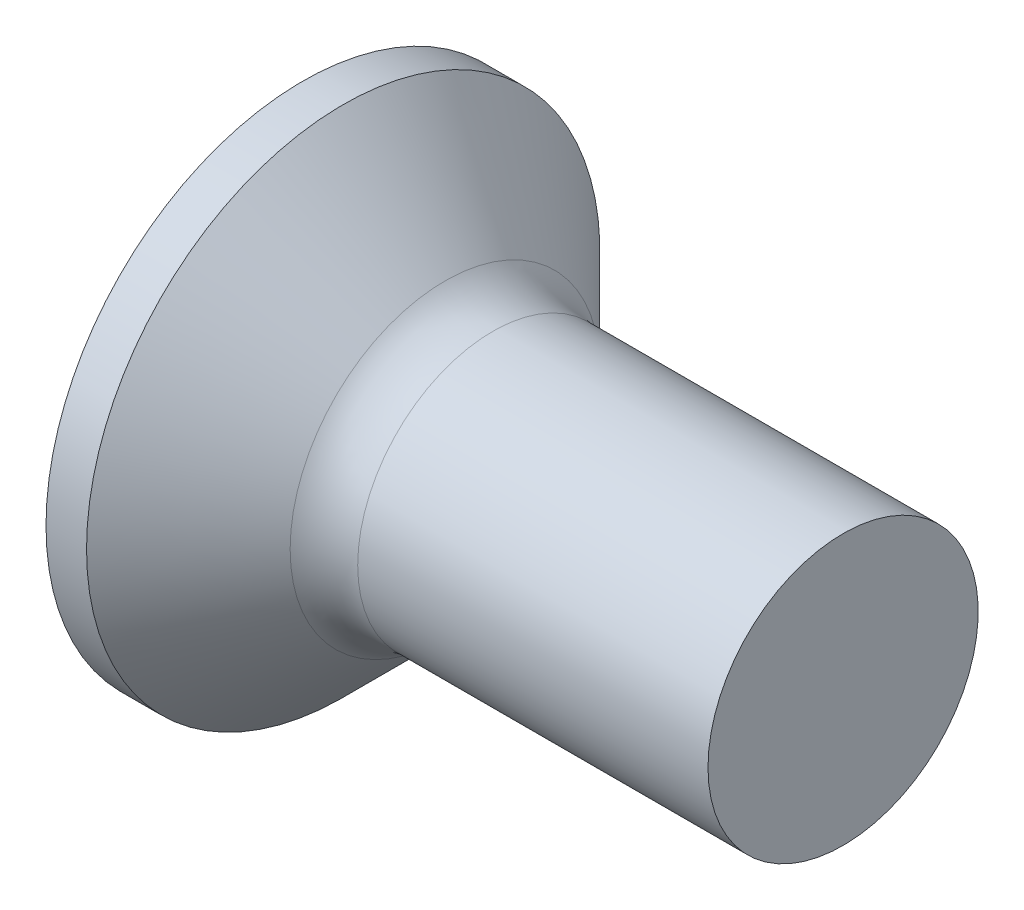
ISO-10303-21;
HEADER;
FILE_DESCRIPTION(('STEP AP214'),'2;1');
FILE_NAME('part.step','',(''),(''),'','','');
FILE_SCHEMA(('AUTOMOTIVE_DESIGN { 1 0 10303 214 1 1 1 1 }'));
ENDSEC;
DATA;
#1=APPLICATION_CONTEXT('core data for automotive mechanical design processes');
#2=APPLICATION_PROTOCOL_DEFINITION('international standard','automotive_design',2000,#1);
#3=PRODUCT_CONTEXT('',#1,'mechanical');
#4=PRODUCT('Part','Part','',(#3));
#5=PRODUCT_RELATED_PRODUCT_CATEGORY('part','',(#4));
#6=PRODUCT_DEFINITION_FORMATION('','',#4);
#7=PRODUCT_DEFINITION_CONTEXT('part definition',#1,'design');
#8=PRODUCT_DEFINITION('design','',#6,#7);
#9=PRODUCT_DEFINITION_SHAPE('','',#8);
#10=(LENGTH_UNIT() NAMED_UNIT(*) SI_UNIT(.MILLI.,.METRE.));
#11=(NAMED_UNIT(*) PLANE_ANGLE_UNIT() SI_UNIT($,.RADIAN.));
#12=(NAMED_UNIT(*) SI_UNIT($,.STERADIAN.) SOLID_ANGLE_UNIT());
#13=UNCERTAINTY_MEASURE_WITH_UNIT(LENGTH_MEASURE(1.E-05),#10,'distance_accuracy_value','');
#14=(GEOMETRIC_REPRESENTATION_CONTEXT(3) GLOBAL_UNCERTAINTY_ASSIGNED_CONTEXT((#13)) GLOBAL_UNIT_ASSIGNED_CONTEXT((#10,
#11,#12)) REPRESENTATION_CONTEXT('',''));
#15=CARTESIAN_POINT('',(0.,0.,0.));
#16=DIRECTION('',(0.,0.,1.));
#17=DIRECTION('',(1.,0.,0.));
#18=AXIS2_PLACEMENT_3D('',#15,#16,#17);
#19=CARTESIAN_POINT('',(0.,-0.949999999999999,0.24));
#20=DIRECTION('',(0.,0.,-1.));
#21=DIRECTION('',(0.,1.,0.));
#22=AXIS2_PLACEMENT_3D('',#19,#20,#21);
#23=PLANE('',#22);
#24=DIRECTION('',(0.,-1.,0.));
#25=VECTOR('',#24,1.);
#26=CARTESIAN_POINT('',(0.,0.95,0.24));
#27=LINE('',#26,#25);
#28=CARTESIAN_POINT('',(0.,-0.368080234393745,0.24));
#29=VERTEX_POINT('',#28);
#30=CARTESIAN_POINT('',(0.,-0.95,0.24));
#31=VERTEX_POINT('',#30);
#32=EDGE_CURVE('E458',#29,#31,#27,.T.);
#33=ORIENTED_EDGE('',*,*,#32,.F.);
#34=CARTESIAN_POINT('',(-0.647693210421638,-0.421114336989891,0.24));
#35=CARTESIAN_POINT('',(-0.514503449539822,-0.410390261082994,0.24));
#36=CARTESIAN_POINT('',(-0.381320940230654,-0.399574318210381,0.24));
#37=CARTESIAN_POINT('',(-0.114973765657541,-0.377686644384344,0.24));
#38=CARTESIAN_POINT('',(0.0181908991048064,-0.366614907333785,0.24));
#39=CARTESIAN_POINT('',(0.284492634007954,-0.344144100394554,0.24));
#40=CARTESIAN_POINT('',(0.417629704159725,-0.332745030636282,0.24));
#41=CARTESIAN_POINT('',(0.683863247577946,-0.309504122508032,0.24));
#42=CARTESIAN_POINT('',(0.816959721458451,-0.297662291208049,0.24));
#43=CARTESIAN_POINT('',(1.04303435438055,-0.277010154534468,0.24));
#44=CARTESIAN_POINT('',(1.13602713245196,-0.268360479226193,0.24));
#45=CARTESIAN_POINT('',(1.32197255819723,-0.250648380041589,0.24));
#46=CARTESIAN_POINT('',(1.41492520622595,-0.241585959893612,0.24));
#47=CARTESIAN_POINT('',(1.60078125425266,-0.222904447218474,0.24));
#48=CARTESIAN_POINT('',(1.69368465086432,-0.213285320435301,0.24));
#49=CARTESIAN_POINT('',(1.87939874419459,-0.193166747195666,0.24));
#50=CARTESIAN_POINT('',(1.97220943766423,-0.182667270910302,0.24));
#51=CARTESIAN_POINT('',(2.0649517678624,-0.171565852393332,0.24));
#52=B_SPLINE_CURVE_WITH_KNOTS('',3,(#34,#35,#36,#37,#38,#39,#40,#41,#42,#43,#44,#45,#46,#47,#48,
#49,#50,#51),.UNSPECIFIED.,.F.,.F.,(4,2,2,2,2,2,2,2,4),(0.,0.400862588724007,0.801734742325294,
1.2026067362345,1.60347233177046,1.88365413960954,2.16383341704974,2.44402995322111,
2.72423598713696),.UNSPECIFIED.);
#53=CARTESIAN_POINT('',(1.2,-0.262259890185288,0.240000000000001));
#54=VERTEX_POINT('',#53);
#55=EDGE_CURVE('E214',#29,#54,#52,.T.);
#56=ORIENTED_EDGE('',*,*,#55,.T.);
#57=DIRECTION('',(0.,-1.,0.));
#58=VECTOR('',#57,1.);
#59=CARTESIAN_POINT('',(1.2,0.351702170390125,0.24));
#60=LINE('',#59,#58);
#61=CARTESIAN_POINT('',(1.2,-0.351702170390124,0.24));
#62=VERTEX_POINT('',#61);
#63=EDGE_CURVE('E367',#54,#62,#60,.T.);
#64=ORIENTED_EDGE('',*,*,#63,.T.);
#65=DIRECTION('',(0.894934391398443,0.446197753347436,0.));
#66=VECTOR('',#65,1.);
#67=CARTESIAN_POINT('',(0.,-0.95,0.24));
#68=LINE('',#67,#66);
#69=EDGE_CURVE('E466',#31,#62,#68,.T.);
#70=ORIENTED_EDGE('',*,*,#69,.F.);
#71=EDGE_LOOP('',(#33,#56,#64,#70));
#72=FACE_BOUND('',#71,.T.);
#73=ADVANCED_FACE('F35',(#72),#23,.T.);
#74=CARTESIAN_POINT('',(1.2,0.351702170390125,0.24));
#75=VERTEX_POINT('',#74);
#76=CARTESIAN_POINT('',(1.2,0.262259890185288,0.24));
#77=VERTEX_POINT('',#76);
#78=EDGE_CURVE('E363',#75,#77,#60,.T.);
#79=ORIENTED_EDGE('',*,*,#78,.T.);
#80=CARTESIAN_POINT('',(-0.647693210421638,0.421114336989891,0.24));
#81=CARTESIAN_POINT('',(-0.514503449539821,0.410390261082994,0.24));
#82=CARTESIAN_POINT('',(-0.381320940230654,0.399574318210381,0.24));
#83=CARTESIAN_POINT('',(-0.114973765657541,0.377686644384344,0.24));
#84=CARTESIAN_POINT('',(0.0181908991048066,0.366614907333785,0.24));
#85=CARTESIAN_POINT('',(0.284492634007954,0.344144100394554,0.24));
#86=CARTESIAN_POINT('',(0.417629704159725,0.332745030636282,0.24));
#87=CARTESIAN_POINT('',(0.683863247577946,0.309504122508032,0.24));
#88=CARTESIAN_POINT('',(0.816959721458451,0.297662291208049,0.24));
#89=CARTESIAN_POINT('',(1.04303435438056,0.277010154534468,0.24));
#90=CARTESIAN_POINT('',(1.13602713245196,0.268360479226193,0.24));
#91=CARTESIAN_POINT('',(1.32197255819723,0.250648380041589,0.24));
#92=CARTESIAN_POINT('',(1.41492520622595,0.241585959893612,0.24));
#93=CARTESIAN_POINT('',(1.60078125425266,0.222904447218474,0.24));
#94=CARTESIAN_POINT('',(1.69368465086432,0.213285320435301,0.24));
#95=CARTESIAN_POINT('',(1.87939874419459,0.193166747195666,0.24));
#96=CARTESIAN_POINT('',(1.97220943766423,0.182667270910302,0.24));
#97=CARTESIAN_POINT('',(2.0649517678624,0.171565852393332,0.24));
#98=B_SPLINE_CURVE_WITH_KNOTS('',3,(#80,#81,#82,#83,#84,#85,#86,#87,#88,#89,#90,#91,#92,#93,#94,
#95,#96,#97),.UNSPECIFIED.,.F.,.F.,(4,2,2,2,2,2,2,2,4),(0.,0.400862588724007,0.801734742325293,
1.2026067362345,1.60347233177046,1.88365413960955,2.16383341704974,2.44402995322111,
2.72423598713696),.UNSPECIFIED.);
#99=CARTESIAN_POINT('',(0.,0.368080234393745,0.24));
#100=VERTEX_POINT('',#99);
#101=EDGE_CURVE('E207',#77,#100,#98,.F.);
#102=ORIENTED_EDGE('',*,*,#101,.T.);
#103=CARTESIAN_POINT('',(0.,0.95,0.24));
#104=VERTEX_POINT('',#103);
#105=EDGE_CURVE('E460',#104,#100,#27,.T.);
#106=ORIENTED_EDGE('',*,*,#105,.F.);
#107=DIRECTION('',(0.894934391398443,-0.446197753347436,0.));
#108=VECTOR('',#107,1.);
#109=CARTESIAN_POINT('',(0.,0.95,0.24));
#110=LINE('',#109,#108);
#111=EDGE_CURVE('E58',#104,#75,#110,.T.);
#112=ORIENTED_EDGE('',*,*,#111,.T.);
#113=EDGE_LOOP('',(#79,#102,#106,#112));
#114=FACE_BOUND('',#113,.T.);
#115=ADVANCED_FACE('F189',(#114),#23,.T.);
#116=CARTESIAN_POINT('',(0.,0.949999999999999,-0.24));
#117=DIRECTION('',(0.,0.,1.));
#118=DIRECTION('',(1.,0.,0.));
#119=AXIS2_PLACEMENT_3D('',#116,#117,#118);
#120=PLANE('',#119);
#121=DIRECTION('',(0.,1.,0.));
#122=VECTOR('',#121,1.);
#123=CARTESIAN_POINT('',(1.2,-0.351702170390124,-0.24));
#124=LINE('',#123,#122);
#125=CARTESIAN_POINT('',(1.2,-0.351702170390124,-0.24));
#126=VERTEX_POINT('',#125);
#127=CARTESIAN_POINT('',(1.2,-0.262259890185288,-0.24));
#128=VERTEX_POINT('',#127);
#129=EDGE_CURVE('E376',#126,#128,#124,.T.);
#130=ORIENTED_EDGE('',*,*,#129,.T.);
#131=CARTESIAN_POINT('',(-0.647693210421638,-0.421114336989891,-0.24));
#132=CARTESIAN_POINT('',(-0.514503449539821,-0.410390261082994,-0.24));
#133=CARTESIAN_POINT('',(-0.381320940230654,-0.399574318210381,-0.24));
#134=CARTESIAN_POINT('',(-0.114973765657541,-0.377686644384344,-0.24));
#135=CARTESIAN_POINT('',(0.0181908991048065,-0.366614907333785,-0.24));
#136=CARTESIAN_POINT('',(0.284492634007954,-0.344144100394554,-0.24));
#137=CARTESIAN_POINT('',(0.417629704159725,-0.332745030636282,-0.24));
#138=CARTESIAN_POINT('',(0.683863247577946,-0.309504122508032,-0.24));
#139=CARTESIAN_POINT('',(0.816959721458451,-0.297662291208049,-0.24));
#140=CARTESIAN_POINT('',(1.04303435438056,-0.277010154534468,-0.24));
#141=CARTESIAN_POINT('',(1.13602713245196,-0.268360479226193,-0.24));
#142=CARTESIAN_POINT('',(1.32197255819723,-0.250648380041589,-0.24));
#143=CARTESIAN_POINT('',(1.41492520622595,-0.241585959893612,-0.24));
#144=CARTESIAN_POINT('',(1.60078125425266,-0.222904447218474,-0.24));
#145=CARTESIAN_POINT('',(1.69368465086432,-0.213285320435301,-0.24));
#146=CARTESIAN_POINT('',(1.87939874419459,-0.193166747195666,-0.24));
#147=CARTESIAN_POINT('',(1.97220943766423,-0.182667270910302,-0.24));
#148=CARTESIAN_POINT('',(2.0649517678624,-0.171565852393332,-0.24));
#149=B_SPLINE_CURVE_WITH_KNOTS('',3,(#131,#132,#133,#134,#135,#136,#137,#138,#139,#140,#141,
#142,#143,#144,#145,#146,#147,#148),.UNSPECIFIED.,.F.,.F.,(4,2,2,2,2,2,2,2,4),(0.,
0.400862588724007,0.801734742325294,1.2026067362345,1.60347233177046,1.88365413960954,
2.16383341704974,2.44402995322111,2.72423598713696),.UNSPECIFIED.);
#150=CARTESIAN_POINT('',(0.,-0.368080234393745,-0.24));
#151=VERTEX_POINT('',#150);
#152=EDGE_CURVE('E270',#128,#151,#149,.F.);
#153=ORIENTED_EDGE('',*,*,#152,.T.);
#154=DIRECTION('',(0.,1.,0.));
#155=VECTOR('',#154,1.);
#156=CARTESIAN_POINT('',(0.,-0.95,-0.24));
#157=LINE('',#156,#155);
#158=CARTESIAN_POINT('',(0.,-0.95,-0.24));
#159=VERTEX_POINT('',#158);
#160=EDGE_CURVE('E459',#159,#151,#157,.T.);
#161=ORIENTED_EDGE('',*,*,#160,.F.);
#162=DIRECTION('',(0.894934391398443,0.446197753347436,0.));
#163=VECTOR('',#162,1.);
#164=CARTESIAN_POINT('',(0.,-0.95,-0.24));
#165=LINE('',#164,#163);
#166=EDGE_CURVE('E469',#159,#126,#165,.T.);
#167=ORIENTED_EDGE('',*,*,#166,.T.);
#168=EDGE_LOOP('',(#130,#153,#161,#167));
#169=FACE_BOUND('',#168,.T.);
#170=ADVANCED_FACE('F195',(#169),#120,.T.);
#171=CARTESIAN_POINT('',(0.,0.368080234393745,-0.24));
#172=VERTEX_POINT('',#171);
#173=CARTESIAN_POINT('',(0.,0.95,-0.24));
#174=VERTEX_POINT('',#173);
#175=EDGE_CURVE('E465',#172,#174,#157,.T.);
#176=ORIENTED_EDGE('',*,*,#175,.F.);
#177=CARTESIAN_POINT('',(-0.647693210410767,0.421114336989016,-0.24));
#178=CARTESIAN_POINT('',(-0.514503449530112,0.410390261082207,-0.24));
#179=CARTESIAN_POINT('',(-0.381320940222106,0.399574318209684,-0.24));
#180=CARTESIAN_POINT('',(-0.114973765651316,0.377686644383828,-0.24));
#181=CARTESIAN_POINT('',(0.0181908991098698,0.366614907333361,-0.24));
#182=CARTESIAN_POINT('',(0.284492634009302,0.344144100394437,-0.24));
#183=CARTESIAN_POINT('',(0.417629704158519,0.332745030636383,-0.24));
#184=CARTESIAN_POINT('',(0.683863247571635,0.309504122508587,-0.24));
#185=CARTESIAN_POINT('',(0.816959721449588,0.29766229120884,-0.24));
#186=CARTESIAN_POINT('',(1.04303435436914,0.277010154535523,-0.24));
#187=CARTESIAN_POINT('',(1.13602713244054,0.268360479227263,-0.24));
#188=CARTESIAN_POINT('',(1.32197255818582,0.250648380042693,-0.24));
#189=CARTESIAN_POINT('',(1.41492520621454,0.241585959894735,-0.24));
#190=CARTESIAN_POINT('',(1.60078125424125,0.222904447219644,-0.24));
#191=CARTESIAN_POINT('',(1.69368465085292,0.213285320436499,-0.24));
#192=CARTESIAN_POINT('',(1.8793987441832,0.193166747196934,-0.24));
#193=CARTESIAN_POINT('',(1.97220943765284,0.182667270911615,-0.24));
#194=CARTESIAN_POINT('',(2.06495176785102,0.171565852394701,-0.24));
#195=B_SPLINE_CURVE_WITH_KNOTS('',3,(#177,#178,#179,#180,#181,#182,#183,#184,#185,#186,#187,
#188,#189,#190,#191,#192,#193,#194),.UNSPECIFIED.,.F.,.F.,(4,2,2,2,2,2,2,2,4),(0.,
0.400862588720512,0.801734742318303,1.20260673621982,1.60347233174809,1.88365413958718,
2.16383341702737,2.44402995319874,2.72423598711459),.UNSPECIFIED.);
#196=CARTESIAN_POINT('',(1.2,0.262259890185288,-0.24));
#197=VERTEX_POINT('',#196);
#198=EDGE_CURVE('E264',#172,#197,#195,.T.);
#199=ORIENTED_EDGE('',*,*,#198,.T.);
#200=CARTESIAN_POINT('',(1.2,0.351702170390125,-0.24));
#201=VERTEX_POINT('',#200);
#202=EDGE_CURVE('E378',#197,#201,#124,.T.);
#203=ORIENTED_EDGE('',*,*,#202,.T.);
#204=DIRECTION('',(0.894934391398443,-0.446197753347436,0.));
#205=VECTOR('',#204,1.);
#206=CARTESIAN_POINT('',(0.,0.95,-0.24));
#207=LINE('',#206,#205);
#208=EDGE_CURVE('E375',#174,#201,#207,.T.);
#209=ORIENTED_EDGE('',*,*,#208,.F.);
#210=EDGE_LOOP('',(#176,#199,#203,#209));
#211=FACE_BOUND('',#210,.T.);
#212=ADVANCED_FACE('F476',(#211),#120,.T.);
#213=CARTESIAN_POINT('',(1.2,0.351702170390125,-0.24));
#214=DIRECTION('',(1.,0.,0.));
#215=DIRECTION('',(0.,0.,-1.));
#216=AXIS2_PLACEMENT_3D('',#213,#214,#215);
#217=PLANE('',#216);
#218=CARTESIAN_POINT('',(1.2,0.,0.));
#219=DIRECTION('',(-1.,0.,0.));
#220=DIRECTION('',(0.,0.,1.));
#221=AXIS2_PLACEMENT_3D('',#218,#219,#220);
#222=CIRCLE('',#221,0.355499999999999);
#223=CARTESIAN_POINT('',(1.2,-0.0518250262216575,-0.351702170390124));
#224=VERTEX_POINT('',#223);
#225=CARTESIAN_POINT('',(1.2,-0.239999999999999,-0.262259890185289));
#226=VERTEX_POINT('',#225);
#227=EDGE_CURVE('E342',#224,#226,#222,.T.);
#228=ORIENTED_EDGE('',*,*,#227,.F.);
#229=DIRECTION('',(0.,1.,0.));
#230=VECTOR('',#229,1.);
#231=CARTESIAN_POINT('',(1.2,-0.239999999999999,-0.351702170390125));
#232=LINE('',#231,#230);
#233=CARTESIAN_POINT('',(1.2,-0.239999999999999,-0.351702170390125));
#234=VERTEX_POINT('',#233);
#235=EDGE_CURVE('E443',#234,#224,#232,.T.);
#236=ORIENTED_EDGE('',*,*,#235,.F.);
#237=DIRECTION('',(0.,0.,-1.));
#238=VECTOR('',#237,1.);
#239=CARTESIAN_POINT('',(1.2,-0.240000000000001,0.351702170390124));
#240=LINE('',#239,#238);
#241=EDGE_CURVE('E447',#226,#234,#240,.T.);
#242=ORIENTED_EDGE('',*,*,#241,.F.);
#243=EDGE_LOOP('',(#228,#236,#242));
#244=FACE_BOUND('',#243,.T.);
#245=ADVANCED_FACE('F489',(#244),#217,.F.);
#246=CARTESIAN_POINT('',(1.2,-0.351702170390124,-0.0518250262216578));
#247=VERTEX_POINT('',#246);
#248=EDGE_CURVE('E337',#128,#247,#222,.T.);
#249=ORIENTED_EDGE('',*,*,#248,.F.);
#250=ORIENTED_EDGE('',*,*,#129,.F.);
#251=DIRECTION('',(0.,0.,-1.));
#252=VECTOR('',#251,1.);
#253=CARTESIAN_POINT('',(1.2,-0.351702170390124,0.24));
#254=LINE('',#253,#252);
#255=EDGE_CURVE('E366',#247,#126,#254,.T.);
#256=ORIENTED_EDGE('',*,*,#255,.F.);
#257=EDGE_LOOP('',(#249,#250,#256));
#258=FACE_BOUND('',#257,.T.);
#259=ADVANCED_FACE('F495',(#258),#217,.F.);
#260=CARTESIAN_POINT('',(1.2,-0.351702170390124,0.051825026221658));
#261=VERTEX_POINT('',#260);
#262=EDGE_CURVE('E332',#261,#54,#222,.T.);
#263=ORIENTED_EDGE('',*,*,#262,.F.);
#264=EDGE_CURVE('E369',#62,#261,#254,.T.);
#265=ORIENTED_EDGE('',*,*,#264,.F.);
#266=ORIENTED_EDGE('',*,*,#63,.F.);
#267=EDGE_LOOP('',(#263,#265,#266));
#268=FACE_BOUND('',#267,.T.);
#269=ADVANCED_FACE('F501',(#268),#217,.F.);
#270=CARTESIAN_POINT('',(1.2,-0.240000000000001,0.262259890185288));
#271=VERTEX_POINT('',#270);
#272=CARTESIAN_POINT('',(1.2,-0.0518250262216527,0.351702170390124));
#273=VERTEX_POINT('',#272);
#274=EDGE_CURVE('E50',#271,#273,#222,.T.);
#275=ORIENTED_EDGE('',*,*,#274,.F.);
#276=CARTESIAN_POINT('',(1.2,-0.240000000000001,0.351702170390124));
#277=VERTEX_POINT('',#276);
#278=EDGE_CURVE('E449',#277,#271,#240,.T.);
#279=ORIENTED_EDGE('',*,*,#278,.F.);
#280=DIRECTION('',(0.,-1.,0.));
#281=VECTOR('',#280,1.);
#282=CARTESIAN_POINT('',(1.2,0.239999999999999,0.351702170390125));
#283=LINE('',#282,#281);
#284=EDGE_CURVE('E448',#273,#277,#283,.T.);
#285=ORIENTED_EDGE('',*,*,#284,.F.);
#286=EDGE_LOOP('',(#275,#279,#285));
#287=FACE_BOUND('',#286,.T.);
#288=ADVANCED_FACE('F528',(#287),#217,.F.);
#289=CARTESIAN_POINT('',(1.2,0.0518250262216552,0.351702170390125));
#290=VERTEX_POINT('',#289);
#291=CARTESIAN_POINT('',(1.2,0.239999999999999,0.262259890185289));
#292=VERTEX_POINT('',#291);
#293=EDGE_CURVE('E323',#290,#292,#222,.T.);
#294=ORIENTED_EDGE('',*,*,#293,.F.);
#295=CARTESIAN_POINT('',(1.2,0.239999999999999,0.351702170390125));
#296=VERTEX_POINT('',#295);
#297=EDGE_CURVE('E444',#296,#290,#283,.T.);
#298=ORIENTED_EDGE('',*,*,#297,.F.);
#299=DIRECTION('',(0.,0.,1.));
#300=VECTOR('',#299,1.);
#301=CARTESIAN_POINT('',(1.2,0.240000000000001,-0.351702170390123));
#302=LINE('',#301,#300);
#303=EDGE_CURVE('E221',#292,#296,#302,.T.);
#304=ORIENTED_EDGE('',*,*,#303,.F.);
#305=EDGE_LOOP('',(#294,#298,#304));
#306=FACE_BOUND('',#305,.T.);
#307=ADVANCED_FACE('F485',(#306),#217,.F.);
#308=CARTESIAN_POINT('',(1.2,0.351702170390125,0.051825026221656));
#309=VERTEX_POINT('',#308);
#310=EDGE_CURVE('E330',#77,#309,#222,.T.);
#311=ORIENTED_EDGE('',*,*,#310,.F.);
#312=ORIENTED_EDGE('',*,*,#78,.F.);
#313=DIRECTION('',(0.,0.,1.));
#314=VECTOR('',#313,1.);
#315=CARTESIAN_POINT('',(1.2,0.351702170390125,-0.24));
#316=LINE('',#315,#314);
#317=EDGE_CURVE('E364',#309,#75,#316,.T.);
#318=ORIENTED_EDGE('',*,*,#317,.F.);
#319=EDGE_LOOP('',(#311,#312,#318));
#320=FACE_BOUND('',#319,.T.);
#321=ADVANCED_FACE('F362',(#320),#217,.F.);
#322=CARTESIAN_POINT('',(1.2,0.351702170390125,-0.0518250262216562));
#323=VERTEX_POINT('',#322);
#324=EDGE_CURVE('E352',#323,#197,#222,.T.);
#325=ORIENTED_EDGE('',*,*,#324,.F.);
#326=EDGE_CURVE('E371',#201,#323,#316,.T.);
#327=ORIENTED_EDGE('',*,*,#326,.F.);
#328=ORIENTED_EDGE('',*,*,#202,.F.);
#329=EDGE_LOOP('',(#325,#327,#328));
#330=FACE_BOUND('',#329,.T.);
#331=ADVANCED_FACE('F478',(#330),#217,.F.);
#332=CARTESIAN_POINT('',(0.,-0.95,-0.24));
#333=DIRECTION('',(-0.446197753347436,0.894934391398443,0.));
#334=DIRECTION('',(-0.894934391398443,-0.446197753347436,0.));
#335=AXIS2_PLACEMENT_3D('',#332,#333,#334);
#336=PLANE('',#335);
#337=ORIENTED_EDGE('',*,*,#264,.T.);
#338=CARTESIAN_POINT('',(1.81755053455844,-0.0438028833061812,0.));
#339=DIRECTION('',(-0.446197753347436,0.894934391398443,0.));
#340=DIRECTION('',(-0.894934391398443,-0.446197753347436,0.));
#341=AXIS2_PLACEMENT_3D('',#338,#339,#340);
#342=ELLIPSE('',#341,0.69995121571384,0.309229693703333);
#343=EDGE_CURVE('E282',#261,#247,#342,.F.);
#344=ORIENTED_EDGE('',*,*,#343,.T.);
#345=ORIENTED_EDGE('',*,*,#255,.T.);
#346=ORIENTED_EDGE('',*,*,#166,.F.);
#347=DIRECTION('',(0.,0.,-1.));
#348=VECTOR('',#347,1.);
#349=CARTESIAN_POINT('',(0.,-0.95,0.24));
#350=LINE('',#349,#348);
#351=EDGE_CURVE('E383',#31,#159,#350,.T.);
#352=ORIENTED_EDGE('',*,*,#351,.F.);
#353=ORIENTED_EDGE('',*,*,#69,.T.);
#354=EDGE_LOOP('',(#337,#344,#345,#346,#352,#353));
#355=FACE_BOUND('',#354,.T.);
#356=ADVANCED_FACE('F201',(#355),#336,.T.);
#357=CARTESIAN_POINT('',(0.,0.95,0.24));
#358=DIRECTION('',(-0.446197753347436,-0.894934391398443,0.));
#359=DIRECTION('',(0.894934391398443,-0.446197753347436,0.));
#360=AXIS2_PLACEMENT_3D('',#357,#358,#359);
#361=PLANE('',#360);
#362=ORIENTED_EDGE('',*,*,#326,.T.);
#363=CARTESIAN_POINT('',(1.81755053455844,0.0438028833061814,0.));
#364=DIRECTION('',(-0.446197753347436,-0.894934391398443,0.));
#365=DIRECTION('',(-0.894934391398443,0.446197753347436,0.));
#366=AXIS2_PLACEMENT_3D('',#363,#364,#365);
#367=ELLIPSE('',#366,0.69995121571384,0.309229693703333);
#368=EDGE_CURVE('E287',#323,#309,#367,.F.);
#369=ORIENTED_EDGE('',*,*,#368,.T.);
#370=ORIENTED_EDGE('',*,*,#317,.T.);
#371=ORIENTED_EDGE('',*,*,#111,.F.);
#372=DIRECTION('',(0.,0.,1.));
#373=VECTOR('',#372,1.);
#374=CARTESIAN_POINT('',(0.,0.95,-0.24));
#375=LINE('',#374,#373);
#376=EDGE_CURVE('E455',#174,#104,#375,.T.);
#377=ORIENTED_EDGE('',*,*,#376,.F.);
#378=ORIENTED_EDGE('',*,*,#208,.T.);
#379=EDGE_LOOP('',(#362,#369,#370,#371,#377,#378));
#380=FACE_BOUND('',#379,.T.);
#381=ADVANCED_FACE('F474',(#380),#361,.T.);
#382=CARTESIAN_POINT('',(0.,0.239999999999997,0.95));
#383=DIRECTION('',(0.,-1.,0.));
#384=DIRECTION('',(1.,0.,0.));
#385=AXIS2_PLACEMENT_3D('',#382,#383,#384);
#386=PLANE('',#385);
#387=CARTESIAN_POINT('',(1.2,0.240000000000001,-0.351702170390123));
#388=VERTEX_POINT('',#387);
#389=CARTESIAN_POINT('',(1.2,0.240000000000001,-0.262259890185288));
#390=VERTEX_POINT('',#389);
#391=EDGE_CURVE('E453',#388,#390,#302,.T.);
#392=ORIENTED_EDGE('',*,*,#391,.T.);
#393=CARTESIAN_POINT('',(-0.647693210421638,0.240000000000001,-0.42111433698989));
#394=CARTESIAN_POINT('',(-0.514503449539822,0.240000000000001,-0.410390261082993));
#395=CARTESIAN_POINT('',(-0.381320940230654,0.240000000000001,-0.399574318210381));
#396=CARTESIAN_POINT('',(-0.114973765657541,0.240000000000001,-0.377686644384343));
#397=CARTESIAN_POINT('',(0.0181908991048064,0.240000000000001,-0.366614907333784));
#398=CARTESIAN_POINT('',(0.284492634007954,0.240000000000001,-0.344144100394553));
#399=CARTESIAN_POINT('',(0.417629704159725,0.240000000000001,-0.332745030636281));
#400=CARTESIAN_POINT('',(0.683863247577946,0.240000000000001,-0.309504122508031));
#401=CARTESIAN_POINT('',(0.816959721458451,0.240000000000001,-0.297662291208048));
#402=CARTESIAN_POINT('',(1.04303435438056,0.240000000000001,-0.277010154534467));
#403=CARTESIAN_POINT('',(1.13602713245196,0.240000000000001,-0.268360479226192));
#404=CARTESIAN_POINT('',(1.32197255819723,0.240000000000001,-0.250648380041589));
#405=CARTESIAN_POINT('',(1.41492520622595,0.240000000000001,-0.241585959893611));
#406=CARTESIAN_POINT('',(1.60078125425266,0.240000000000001,-0.222904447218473));
#407=CARTESIAN_POINT('',(1.69368465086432,0.240000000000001,-0.213285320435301));
#408=CARTESIAN_POINT('',(1.87939874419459,0.240000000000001,-0.193166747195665));
#409=CARTESIAN_POINT('',(1.97220943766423,0.240000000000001,-0.182667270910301));
#410=CARTESIAN_POINT('',(2.0649517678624,0.240000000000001,-0.171565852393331));
#411=B_SPLINE_CURVE_WITH_KNOTS('',3,(#393,#394,#395,#396,#397,#398,#399,#400,#401,#402,#403,
#404,#405,#406,#407,#408,#409,#410),.UNSPECIFIED.,.F.,.F.,(4,2,2,2,2,2,2,2,4),(0.,
0.400862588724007,0.801734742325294,1.2026067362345,1.60347233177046,1.88365413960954,
2.16383341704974,2.44402995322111,2.72423598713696),.UNSPECIFIED.);
#412=CARTESIAN_POINT('',(0.,0.240000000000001,-0.368080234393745));
#413=VERTEX_POINT('',#412);
#414=EDGE_CURVE('E256',#390,#413,#411,.F.);
#415=ORIENTED_EDGE('',*,*,#414,.T.);
#416=DIRECTION('',(0.,0.,1.));
#417=VECTOR('',#416,1.);
#418=CARTESIAN_POINT('',(0.,0.240000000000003,-0.949999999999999));
#419=LINE('',#418,#417);
#420=CARTESIAN_POINT('',(0.,0.240000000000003,-0.949999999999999));
#421=VERTEX_POINT('',#420);
#422=EDGE_CURVE('E429',#421,#413,#419,.T.);
#423=ORIENTED_EDGE('',*,*,#422,.F.);
#424=DIRECTION('',(0.894934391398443,0.,0.446197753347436));
#425=VECTOR('',#424,1.);
#426=CARTESIAN_POINT('',(0.,0.240000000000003,-0.949999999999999));
#427=LINE('',#426,#425);
#428=EDGE_CURVE('E435',#421,#388,#427,.T.);
#429=ORIENTED_EDGE('',*,*,#428,.T.);
#430=EDGE_LOOP('',(#392,#415,#423,#429));
#431=FACE_BOUND('',#430,.T.);
#432=ADVANCED_FACE('F608',(#431),#386,.T.);
#433=CARTESIAN_POINT('',(0.,-0.239999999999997,-0.95));
#434=DIRECTION('',(0.,1.,0.));
#435=DIRECTION('',(0.,0.,1.));
#436=AXIS2_PLACEMENT_3D('',#433,#434,#435);
#437=PLANE('',#436);
#438=DIRECTION('',(0.,0.,-1.));
#439=VECTOR('',#438,1.);
#440=CARTESIAN_POINT('',(0.,-0.240000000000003,0.949999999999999));
#441=LINE('',#440,#439);
#442=CARTESIAN_POINT('',(0.,-0.239999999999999,-0.368080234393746));
#443=VERTEX_POINT('',#442);
#444=CARTESIAN_POINT('',(0.,-0.239999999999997,-0.950000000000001));
#445=VERTEX_POINT('',#444);
#446=EDGE_CURVE('E425',#443,#445,#441,.T.);
#447=ORIENTED_EDGE('',*,*,#446,.F.);
#448=CARTESIAN_POINT('',(-0.647693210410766,-0.239999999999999,-0.421114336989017));
#449=CARTESIAN_POINT('',(-0.514503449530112,-0.239999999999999,-0.410390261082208));
#450=CARTESIAN_POINT('',(-0.381320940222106,-0.239999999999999,-0.399574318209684));
#451=CARTESIAN_POINT('',(-0.114973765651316,-0.239999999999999,-0.377686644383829));
#452=CARTESIAN_POINT('',(0.0181908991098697,-0.239999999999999,-0.366614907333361));
#453=CARTESIAN_POINT('',(0.284492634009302,-0.239999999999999,-0.344144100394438));
#454=CARTESIAN_POINT('',(0.417629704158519,-0.239999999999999,-0.332745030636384));
#455=CARTESIAN_POINT('',(0.683863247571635,-0.239999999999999,-0.309504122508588));
#456=CARTESIAN_POINT('',(0.816959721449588,-0.239999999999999,-0.297662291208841));
#457=CARTESIAN_POINT('',(1.04303435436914,-0.239999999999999,-0.277010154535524));
#458=CARTESIAN_POINT('',(1.13602713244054,-0.239999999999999,-0.268360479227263));
#459=CARTESIAN_POINT('',(1.32197255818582,-0.239999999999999,-0.250648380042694));
#460=CARTESIAN_POINT('',(1.41492520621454,-0.239999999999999,-0.241585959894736));
#461=CARTESIAN_POINT('',(1.60078125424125,-0.239999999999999,-0.222904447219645));
#462=CARTESIAN_POINT('',(1.69368465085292,-0.239999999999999,-0.2132853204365));
#463=CARTESIAN_POINT('',(1.8793987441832,-0.239999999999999,-0.193166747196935));
#464=CARTESIAN_POINT('',(1.97220943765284,-0.239999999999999,-0.182667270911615));
#465=CARTESIAN_POINT('',(2.06495176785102,-0.239999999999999,-0.171565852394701));
#466=B_SPLINE_CURVE_WITH_KNOTS('',3,(#448,#449,#450,#451,#452,#453,#454,#455,#456,#457,#458,
#459,#460,#461,#462,#463,#464,#465),.UNSPECIFIED.,.F.,.F.,(4,2,2,2,2,2,2,2,4),(0.,
0.400862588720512,0.801734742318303,1.20260673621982,1.60347233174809,1.88365413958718,
2.16383341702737,2.44402995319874,2.72423598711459),.UNSPECIFIED.);
#467=EDGE_CURVE('E249',#443,#226,#466,.T.);
#468=ORIENTED_EDGE('',*,*,#467,.T.);
#469=ORIENTED_EDGE('',*,*,#241,.T.);
#470=DIRECTION('',(0.894934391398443,0.,0.446197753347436));
#471=VECTOR('',#470,1.);
#472=CARTESIAN_POINT('',(0.,-0.239999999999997,-0.950000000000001));
#473=LINE('',#472,#471);
#474=EDGE_CURVE('E432',#445,#234,#473,.T.);
#475=ORIENTED_EDGE('',*,*,#474,.F.);
#476=EDGE_LOOP('',(#447,#468,#469,#475));
#477=FACE_BOUND('',#476,.T.);
#478=ADVANCED_FACE('F506',(#477),#437,.T.);
#479=CARTESIAN_POINT('',(0.,0.240000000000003,-0.949999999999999));
#480=DIRECTION('',(-0.446197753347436,0.,0.894934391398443));
#481=DIRECTION('',(-0.894934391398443,0.,-0.446197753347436));
#482=AXIS2_PLACEMENT_3D('',#479,#480,#481);
#483=PLANE('',#482);
#484=ORIENTED_EDGE('',*,*,#235,.T.);
#485=CARTESIAN_POINT('',(1.81755053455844,0.,-0.0438028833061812));
#486=DIRECTION('',(-0.446197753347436,0.,0.894934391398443));
#487=DIRECTION('',(-0.894934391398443,0.,-0.446197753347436));
#488=AXIS2_PLACEMENT_3D('',#485,#486,#487);
#489=ELLIPSE('',#488,0.69995121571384,0.309229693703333);
#490=CARTESIAN_POINT('',(1.2,0.0518250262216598,-0.351702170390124));
#491=VERTEX_POINT('',#490);
#492=EDGE_CURVE('E300',#224,#491,#489,.F.);
#493=ORIENTED_EDGE('',*,*,#492,.T.);
#494=EDGE_CURVE('E451',#491,#388,#232,.T.);
#495=ORIENTED_EDGE('',*,*,#494,.T.);
#496=ORIENTED_EDGE('',*,*,#428,.F.);
#497=DIRECTION('',(0.,1.,0.));
#498=VECTOR('',#497,1.);
#499=CARTESIAN_POINT('',(0.,-0.239999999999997,-0.950000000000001));
#500=LINE('',#499,#498);
#501=EDGE_CURVE('E424',#445,#421,#500,.T.);
#502=ORIENTED_EDGE('',*,*,#501,.F.);
#503=ORIENTED_EDGE('',*,*,#474,.T.);
#504=EDGE_LOOP('',(#484,#493,#495,#496,#502,#503));
#505=FACE_BOUND('',#504,.T.);
#506=ADVANCED_FACE('F226',(#505),#483,.T.);
#507=ORIENTED_EDGE('',*,*,#278,.T.);
#508=CARTESIAN_POINT('',(-0.647693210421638,-0.240000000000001,0.42111433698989));
#509=CARTESIAN_POINT('',(-0.514503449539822,-0.240000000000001,0.410390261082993));
#510=CARTESIAN_POINT('',(-0.381320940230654,-0.240000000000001,0.39957431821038));
#511=CARTESIAN_POINT('',(-0.114973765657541,-0.240000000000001,0.377686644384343));
#512=CARTESIAN_POINT('',(0.0181908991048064,-0.240000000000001,0.366614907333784));
#513=CARTESIAN_POINT('',(0.284492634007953,-0.240000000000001,0.344144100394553));
#514=CARTESIAN_POINT('',(0.417629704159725,-0.240000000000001,0.332745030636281));
#515=CARTESIAN_POINT('',(0.683863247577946,-0.240000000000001,0.309504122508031));
#516=CARTESIAN_POINT('',(0.816959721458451,-0.240000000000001,0.297662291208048));
#517=CARTESIAN_POINT('',(1.04303435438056,-0.240000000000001,0.277010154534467));
#518=CARTESIAN_POINT('',(1.13602713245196,-0.240000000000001,0.268360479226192));
#519=CARTESIAN_POINT('',(1.32197255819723,-0.240000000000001,0.250648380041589));
#520=CARTESIAN_POINT('',(1.41492520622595,-0.240000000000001,0.241585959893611));
#521=CARTESIAN_POINT('',(1.60078125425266,-0.240000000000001,0.222904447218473));
#522=CARTESIAN_POINT('',(1.69368465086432,-0.240000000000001,0.213285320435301));
#523=CARTESIAN_POINT('',(1.87939874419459,-0.240000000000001,0.193166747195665));
#524=CARTESIAN_POINT('',(1.97220943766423,-0.240000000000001,0.182667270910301));
#525=CARTESIAN_POINT('',(2.0649517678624,-0.240000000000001,0.171565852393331));
#526=B_SPLINE_CURVE_WITH_KNOTS('',3,(#508,#509,#510,#511,#512,#513,#514,#515,#516,#517,#518,
#519,#520,#521,#522,#523,#524,#525),.UNSPECIFIED.,.F.,.F.,(4,2,2,2,2,2,2,2,4),(0.,
0.400862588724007,0.801734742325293,1.2026067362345,1.60347233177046,1.88365413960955,
2.16383341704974,2.44402995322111,2.72423598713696),.UNSPECIFIED.);
#527=CARTESIAN_POINT('',(0.,-0.240000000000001,0.368080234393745));
#528=VERTEX_POINT('',#527);
#529=EDGE_CURVE('E241',#271,#528,#526,.F.);
#530=ORIENTED_EDGE('',*,*,#529,.T.);
#531=CARTESIAN_POINT('',(0.,-0.240000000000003,0.949999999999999));
#532=VERTEX_POINT('',#531);
#533=EDGE_CURVE('E420',#532,#528,#441,.T.);
#534=ORIENTED_EDGE('',*,*,#533,.F.);
#535=DIRECTION('',(0.894934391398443,0.,-0.446197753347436));
#536=VECTOR('',#535,1.);
#537=CARTESIAN_POINT('',(0.,-0.240000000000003,0.949999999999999));
#538=LINE('',#537,#536);
#539=EDGE_CURVE('E438',#532,#277,#538,.T.);
#540=ORIENTED_EDGE('',*,*,#539,.T.);
#541=EDGE_LOOP('',(#507,#530,#534,#540));
#542=FACE_BOUND('',#541,.T.);
#543=ADVANCED_FACE('F526',(#542),#437,.T.);
#544=CARTESIAN_POINT('',(0.,0.239999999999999,0.368080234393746));
#545=VERTEX_POINT('',#544);
#546=CARTESIAN_POINT('',(0.,0.239999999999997,0.950000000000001));
#547=VERTEX_POINT('',#546);
#548=EDGE_CURVE('E431',#545,#547,#419,.T.);
#549=ORIENTED_EDGE('',*,*,#548,.F.);
#550=CARTESIAN_POINT('',(-0.647693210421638,0.239999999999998,0.421114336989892));
#551=CARTESIAN_POINT('',(-0.514503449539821,0.239999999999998,0.410390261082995));
#552=CARTESIAN_POINT('',(-0.381320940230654,0.239999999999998,0.399574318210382));
#553=CARTESIAN_POINT('',(-0.114973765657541,0.239999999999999,0.377686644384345));
#554=CARTESIAN_POINT('',(0.0181908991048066,0.239999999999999,0.366614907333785));
#555=CARTESIAN_POINT('',(0.284492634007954,0.239999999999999,0.344144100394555));
#556=CARTESIAN_POINT('',(0.417629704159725,0.239999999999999,0.332745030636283));
#557=CARTESIAN_POINT('',(0.683863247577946,0.239999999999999,0.309504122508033));
#558=CARTESIAN_POINT('',(0.816959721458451,0.239999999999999,0.29766229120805));
#559=CARTESIAN_POINT('',(1.04303435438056,0.239999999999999,0.277010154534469));
#560=CARTESIAN_POINT('',(1.13602713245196,0.239999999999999,0.268360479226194));
#561=CARTESIAN_POINT('',(1.32197255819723,0.239999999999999,0.25064838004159));
#562=CARTESIAN_POINT('',(1.41492520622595,0.239999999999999,0.241585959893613));
#563=CARTESIAN_POINT('',(1.60078125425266,0.239999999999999,0.222904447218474));
#564=CARTESIAN_POINT('',(1.69368465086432,0.239999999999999,0.213285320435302));
#565=CARTESIAN_POINT('',(1.87939874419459,0.239999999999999,0.193166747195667));
#566=CARTESIAN_POINT('',(1.97220943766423,0.239999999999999,0.182667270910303));
#567=CARTESIAN_POINT('',(2.0649517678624,0.239999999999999,0.171565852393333));
#568=B_SPLINE_CURVE_WITH_KNOTS('',3,(#550,#551,#552,#553,#554,#555,#556,#557,#558,#559,#560,
#561,#562,#563,#564,#565,#566,#567),.UNSPECIFIED.,.F.,.F.,(4,2,2,2,2,2,2,2,4),(0.,
0.400862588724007,0.801734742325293,1.2026067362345,1.60347233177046,1.88365413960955,
2.16383341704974,2.44402995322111,2.72423598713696),.UNSPECIFIED.);
#569=EDGE_CURVE('E231',#545,#292,#568,.T.);
#570=ORIENTED_EDGE('',*,*,#569,.T.);
#571=ORIENTED_EDGE('',*,*,#303,.T.);
#572=DIRECTION('',(0.894934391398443,0.,-0.446197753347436));
#573=VECTOR('',#572,1.);
#574=CARTESIAN_POINT('',(0.,0.239999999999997,0.950000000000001));
#575=LINE('',#574,#573);
#576=EDGE_CURVE('E440',#547,#296,#575,.T.);
#577=ORIENTED_EDGE('',*,*,#576,.F.);
#578=EDGE_LOOP('',(#549,#570,#571,#577));
#579=FACE_BOUND('',#578,.T.);
#580=ADVANCED_FACE('F521',(#579),#386,.T.);
#581=CARTESIAN_POINT('',(0.,-0.240000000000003,0.949999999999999));
#582=DIRECTION('',(-0.446197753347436,0.,-0.894934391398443));
#583=DIRECTION('',(0.894934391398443,0.,-0.446197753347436));
#584=AXIS2_PLACEMENT_3D('',#581,#582,#583);
#585=PLANE('',#584);
#586=ORIENTED_EDGE('',*,*,#297,.T.);
#587=CARTESIAN_POINT('',(1.81755053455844,0.,0.0438028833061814));
#588=DIRECTION('',(-0.446197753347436,0.,-0.894934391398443));
#589=DIRECTION('',(-0.894934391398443,0.,0.446197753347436));
#590=AXIS2_PLACEMENT_3D('',#587,#588,#589);
#591=ELLIPSE('',#590,0.69995121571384,0.309229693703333);
#592=EDGE_CURVE('E11',#290,#273,#591,.F.);
#593=ORIENTED_EDGE('',*,*,#592,.T.);
#594=ORIENTED_EDGE('',*,*,#284,.T.);
#595=ORIENTED_EDGE('',*,*,#539,.F.);
#596=DIRECTION('',(0.,-1.,0.));
#597=VECTOR('',#596,1.);
#598=CARTESIAN_POINT('',(0.,0.239999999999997,0.950000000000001));
#599=LINE('',#598,#597);
#600=EDGE_CURVE('E222',#547,#532,#599,.T.);
#601=ORIENTED_EDGE('',*,*,#600,.F.);
#602=ORIENTED_EDGE('',*,*,#576,.T.);
#603=EDGE_LOOP('',(#586,#593,#594,#595,#601,#602));
#604=FACE_BOUND('',#603,.T.);
#605=ADVANCED_FACE('F418',(#604),#585,.T.);
#606=CARTESIAN_POINT('',(0.,0.,0.));
#607=DIRECTION('',(-1.,0.,0.));
#608=DIRECTION('',(0.,0.,1.));
#609=AXIS2_PLACEMENT_3D('',#606,#607,#608);
#610=PLANE('',#609);
#611=CARTESIAN_POINT('',(0.,0.,0.));
#612=DIRECTION('',(-1.,0.,0.));
#613=DIRECTION('',(0.,0.,1.));
#614=AXIS2_PLACEMENT_3D('',#611,#612,#613);
#615=CIRCLE('',#614,1.9);
#616=CARTESIAN_POINT('',(0.,0.,1.9));
#617=VERTEX_POINT('',#616);
#618=EDGE_CURVE('E386',#617,#617,#615,.T.);
#619=ORIENTED_EDGE('',*,*,#618,.T.);
#620=EDGE_LOOP('',(#619));
#621=FACE_BOUND('',#620,.T.);
#622=ORIENTED_EDGE('',*,*,#533,.T.);
#623=CARTESIAN_POINT('',(0.,0.,0.));
#624=DIRECTION('',(-1.,0.,0.));
#625=DIRECTION('',(0.,0.,1.));
#626=AXIS2_PLACEMENT_3D('',#623,#624,#625);
#627=CIRCLE('',#626,0.439412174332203);
#628=EDGE_CURVE('E318',#29,#528,#627,.T.);
#629=ORIENTED_EDGE('',*,*,#628,.F.);
#630=ORIENTED_EDGE('',*,*,#32,.T.);
#631=ORIENTED_EDGE('',*,*,#351,.T.);
#632=ORIENTED_EDGE('',*,*,#160,.T.);
#633=EDGE_CURVE('E321',#443,#151,#627,.T.);
#634=ORIENTED_EDGE('',*,*,#633,.F.);
#635=ORIENTED_EDGE('',*,*,#446,.T.);
#636=ORIENTED_EDGE('',*,*,#501,.T.);
#637=ORIENTED_EDGE('',*,*,#422,.T.);
#638=EDGE_CURVE('E317',#172,#413,#627,.T.);
#639=ORIENTED_EDGE('',*,*,#638,.F.);
#640=ORIENTED_EDGE('',*,*,#175,.T.);
#641=ORIENTED_EDGE('',*,*,#376,.T.);
#642=ORIENTED_EDGE('',*,*,#105,.T.);
#643=EDGE_CURVE('E313',#545,#100,#627,.T.);
#644=ORIENTED_EDGE('',*,*,#643,.F.);
#645=ORIENTED_EDGE('',*,*,#548,.T.);
#646=ORIENTED_EDGE('',*,*,#600,.T.);
#647=EDGE_LOOP('',(#622,#629,#630,#631,#632,#634,#635,#636,#637,#639,#640,#641,#642,#644,#645,#646));
#648=FACE_BOUND('',#647,.T.);
#649=ADVANCED_FACE('F412',(#621,#648),#610,.T.);
#650=CARTESIAN_POINT('',(-6.34999999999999,0.,0.));
#651=DIRECTION('',(-1.,0.,0.));
#652=DIRECTION('',(0.,0.,1.));
#653=AXIS2_PLACEMENT_3D('',#650,#651,#652);
#654=CYLINDRICAL_SURFACE('',#653,1.9);
#655=CARTESIAN_POINT('',(0.300000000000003,0.,0.));
#656=DIRECTION('',(-1.,0.,0.));
#657=DIRECTION('',(0.,0.,1.));
#658=AXIS2_PLACEMENT_3D('',#655,#656,#657);
#659=CIRCLE('',#658,1.9);
#660=CARTESIAN_POINT('',(0.300000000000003,0.,1.9));
#661=VERTEX_POINT('',#660);
#662=EDGE_CURVE('E382',#661,#661,#659,.T.);
#663=ORIENTED_EDGE('',*,*,#662,.T.);
#664=EDGE_LOOP('',(#663));
#665=FACE_BOUND('',#664,.T.);
#666=ORIENTED_EDGE('',*,*,#618,.F.);
#667=EDGE_LOOP('',(#666));
#668=FACE_BOUND('',#667,.T.);
#669=ADVANCED_FACE('F406',(#665,#668),#654,.T.);
#670=CARTESIAN_POINT('',(0.300000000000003,0.,0.));
#671=DIRECTION('',(-1.,0.,0.));
#672=DIRECTION('',(0.,0.,1.));
#673=AXIS2_PLACEMENT_3D('',#670,#671,#672);
#674=CONICAL_SURFACE('',#673,1.9,0.78539816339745);
#675=CARTESIAN_POINT('',(1.05355339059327,0.,0.));
#676=DIRECTION('',(-1.,0.,0.));
#677=DIRECTION('',(0.,0.,1.));
#678=AXIS2_PLACEMENT_3D('',#675,#676,#677);
#679=CIRCLE('',#678,1.14644660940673);
#680=CARTESIAN_POINT('',(1.05355339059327,0.,1.14644660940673));
#681=VERTEX_POINT('',#680);
#682=EDGE_CURVE('E389',#681,#681,#679,.T.);
#683=ORIENTED_EDGE('',*,*,#682,.T.);
#684=EDGE_LOOP('',(#683));
#685=FACE_BOUND('',#684,.T.);
#686=ORIENTED_EDGE('',*,*,#662,.F.);
#687=EDGE_LOOP('',(#686));
#688=FACE_BOUND('',#687,.T.);
#689=ADVANCED_FACE('F403',(#685,#688),#674,.T.);
#690=CARTESIAN_POINT('',(-6.34999999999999,0.,0.));
#691=DIRECTION('',(-1.,0.,0.));
#692=DIRECTION('',(0.,0.,1.));
#693=AXIS2_PLACEMENT_3D('',#690,#691,#692);
#694=CYLINDRICAL_SURFACE('',#693,1.);
#695=CARTESIAN_POINT('',(1.40710678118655,0.,0.));
#696=DIRECTION('',(-1.,0.,0.));
#697=DIRECTION('',(0.,0.,1.));
#698=AXIS2_PLACEMENT_3D('',#695,#696,#697);
#699=CIRCLE('',#698,1.);
#700=CARTESIAN_POINT('',(1.40710678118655,0.,1.));
#701=VERTEX_POINT('',#700);
#702=EDGE_CURVE('E43',#701,#701,#699,.F.);
#703=ORIENTED_EDGE('',*,*,#702,.T.);
#704=EDGE_LOOP('',(#703));
#705=FACE_BOUND('',#704,.T.);
#706=CARTESIAN_POINT('',(4.,0.,0.));
#707=DIRECTION('',(-1.,0.,0.));
#708=DIRECTION('',(0.,0.,1.));
#709=AXIS2_PLACEMENT_3D('',#706,#707,#708);
#710=CIRCLE('',#709,1.);
#711=CARTESIAN_POINT('',(4.,0.,1.));
#712=VERTEX_POINT('',#711);
#713=EDGE_CURVE('E379',#712,#712,#710,.T.);
#714=ORIENTED_EDGE('',*,*,#713,.T.);
#715=EDGE_LOOP('',(#714));
#716=FACE_BOUND('',#715,.T.);
#717=ADVANCED_FACE('F394',(#705,#716),#694,.T.);
#718=CARTESIAN_POINT('',(4.,1.,0.));
#719=DIRECTION('',(1.,0.,0.));
#720=DIRECTION('',(0.,0.,-1.));
#721=AXIS2_PLACEMENT_3D('',#718,#719,#720);
#722=PLANE('',#721);
#723=ORIENTED_EDGE('',*,*,#713,.F.);
#724=EDGE_LOOP('',(#723));
#725=FACE_BOUND('',#724,.T.);
#726=ADVANCED_FACE('F400',(#725),#722,.T.);
#727=CARTESIAN_POINT('',(1.40710678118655,0.,0.));
#728=DIRECTION('',(-1.,0.,0.));
#729=DIRECTION('',(0.,0.,1.));
#730=AXIS2_PLACEMENT_3D('',#727,#728,#729);
#731=TOROIDAL_SURFACE('',#730,1.5,0.5);
#732=ORIENTED_EDGE('',*,*,#702,.F.);
#733=EDGE_LOOP('',(#732));
#734=FACE_BOUND('',#733,.T.);
#735=ORIENTED_EDGE('',*,*,#682,.F.);
#736=EDGE_LOOP('',(#735));
#737=FACE_BOUND('',#736,.T.);
#738=ADVANCED_FACE('F37',(#734,#737),#731,.F.);
#739=EDGE_CURVE('E347',#390,#491,#222,.T.);
#740=ORIENTED_EDGE('',*,*,#739,.F.);
#741=ORIENTED_EDGE('',*,*,#391,.F.);
#742=ORIENTED_EDGE('',*,*,#494,.F.);
#743=EDGE_LOOP('',(#740,#741,#742));
#744=FACE_BOUND('',#743,.T.);
#745=ADVANCED_FACE('F399',(#744),#217,.F.);
#746=CARTESIAN_POINT('',(1.2,0.,0.));
#747=DIRECTION('',(-1.,0.,0.));
#748=DIRECTION('',(0.,0.,1.));
#749=AXIS2_PLACEMENT_3D('',#746,#747,#748);
#750=CONICAL_SURFACE('',#749,0.355499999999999,0.0698131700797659);
#751=ORIENTED_EDGE('',*,*,#628,.T.);
#752=ORIENTED_EDGE('',*,*,#529,.F.);
#753=EDGE_CURVE('E331',#54,#271,#222,.T.);
#754=ORIENTED_EDGE('',*,*,#753,.F.);
#755=ORIENTED_EDGE('',*,*,#55,.F.);
#756=EDGE_LOOP('',(#751,#752,#754,#755));
#757=FACE_BOUND('',#756,.T.);
#758=ADVANCED_FACE('F186',(#757),#750,.F.);
#759=EDGE_CURVE('E326',#292,#77,#222,.T.);
#760=ORIENTED_EDGE('',*,*,#759,.F.);
#761=ORIENTED_EDGE('',*,*,#569,.F.);
#762=ORIENTED_EDGE('',*,*,#643,.T.);
#763=ORIENTED_EDGE('',*,*,#101,.F.);
#764=EDGE_LOOP('',(#760,#761,#762,#763));
#765=FACE_BOUND('',#764,.T.);
#766=ADVANCED_FACE('F493',(#765),#750,.F.);
#767=EDGE_CURVE('E339',#226,#128,#222,.T.);
#768=ORIENTED_EDGE('',*,*,#767,.F.);
#769=ORIENTED_EDGE('',*,*,#467,.F.);
#770=ORIENTED_EDGE('',*,*,#633,.T.);
#771=ORIENTED_EDGE('',*,*,#152,.F.);
#772=EDGE_LOOP('',(#768,#769,#770,#771));
#773=FACE_BOUND('',#772,.T.);
#774=ADVANCED_FACE('F509',(#773),#750,.F.);
#775=ORIENTED_EDGE('',*,*,#638,.T.);
#776=ORIENTED_EDGE('',*,*,#414,.F.);
#777=EDGE_CURVE('E349',#197,#390,#222,.T.);
#778=ORIENTED_EDGE('',*,*,#777,.F.);
#779=ORIENTED_EDGE('',*,*,#198,.F.);
#780=EDGE_LOOP('',(#775,#776,#778,#779));
#781=FACE_BOUND('',#780,.T.);
#782=ADVANCED_FACE('F511',(#781),#750,.F.);
#783=EDGE_CURVE('E354',#309,#323,#222,.T.);
#784=ORIENTED_EDGE('',*,*,#783,.F.);
#785=ORIENTED_EDGE('',*,*,#368,.F.);
#786=EDGE_LOOP('',(#784,#785));
#787=FACE_BOUND('',#786,.T.);
#788=ADVANCED_FACE('F516',(#787),#750,.F.);
#789=EDGE_CURVE('E334',#247,#261,#222,.T.);
#790=ORIENTED_EDGE('',*,*,#789,.F.);
#791=ORIENTED_EDGE('',*,*,#343,.F.);
#792=EDGE_LOOP('',(#790,#791));
#793=FACE_BOUND('',#792,.T.);
#794=ADVANCED_FACE('F690',(#793),#750,.F.);
#795=EDGE_CURVE('E344',#491,#224,#222,.T.);
#796=ORIENTED_EDGE('',*,*,#795,.F.);
#797=ORIENTED_EDGE('',*,*,#492,.F.);
#798=EDGE_LOOP('',(#796,#797));
#799=FACE_BOUND('',#798,.T.);
#800=ADVANCED_FACE('F183',(#799),#750,.F.);
#801=EDGE_CURVE('E327',#273,#290,#222,.T.);
#802=ORIENTED_EDGE('',*,*,#801,.F.);
#803=ORIENTED_EDGE('',*,*,#592,.F.);
#804=EDGE_LOOP('',(#802,#803));
#805=FACE_BOUND('',#804,.T.);
#806=ADVANCED_FACE('F178',(#805),#750,.F.);
#807=CARTESIAN_POINT('',(1.31550895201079,0.,0.));
#808=DIRECTION('',(-1.,0.,0.));
#809=DIRECTION('',(0.,0.,1.));
#810=AXIS2_PLACEMENT_3D('',#807,#808,#809);
#811=CONICAL_SURFACE('',#810,0.,1.25663706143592);
#812=ORIENTED_EDGE('',*,*,#293,.T.);
#813=ORIENTED_EDGE('',*,*,#759,.T.);
#814=ORIENTED_EDGE('',*,*,#310,.T.);
#815=ORIENTED_EDGE('',*,*,#783,.T.);
#816=ORIENTED_EDGE('',*,*,#324,.T.);
#817=ORIENTED_EDGE('',*,*,#777,.T.);
#818=ORIENTED_EDGE('',*,*,#739,.T.);
#819=ORIENTED_EDGE('',*,*,#795,.T.);
#820=ORIENTED_EDGE('',*,*,#227,.T.);
#821=ORIENTED_EDGE('',*,*,#767,.T.);
#822=ORIENTED_EDGE('',*,*,#248,.T.);
#823=ORIENTED_EDGE('',*,*,#789,.T.);
#824=ORIENTED_EDGE('',*,*,#262,.T.);
#825=ORIENTED_EDGE('',*,*,#753,.T.);
#826=ORIENTED_EDGE('',*,*,#274,.T.);
#827=ORIENTED_EDGE('',*,*,#801,.T.);
#828=EDGE_LOOP('',(#812,#813,#814,#815,#816,#817,#818,#819,#820,#821,#822,#823,#824,#825,#826,#827));
#829=FACE_BOUND('',#828,.T.);
#830=CARTESIAN_POINT('',(1.31550895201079,0.,0.));
#831=VERTEX_POINT('',#830);
#832=VERTEX_LOOP('',#831);
#833=FACE_BOUND('',#832,.T.);
#834=ADVANCED_FACE('F176',(#829,#833),#811,.F.);
#835=CLOSED_SHELL('',(#73,#115,#170,#212,#245,#259,#269,#288,#307,#321,#331,#356,#381,#432,#478,
#506,#543,#580,#605,#649,#669,#689,#717,#726,#738,#745,#758,#766,#774,#782,#788,#794,#800,#806,#834));
#836=MANIFOLD_SOLID_BREP('B2',#835);
#837=ADVANCED_BREP_SHAPE_REPRESENTATION('',(#18,#836),#14);
#838=SHAPE_DEFINITION_REPRESENTATION(#9,#837);
ENDSEC;
END-ISO-10303-21;
